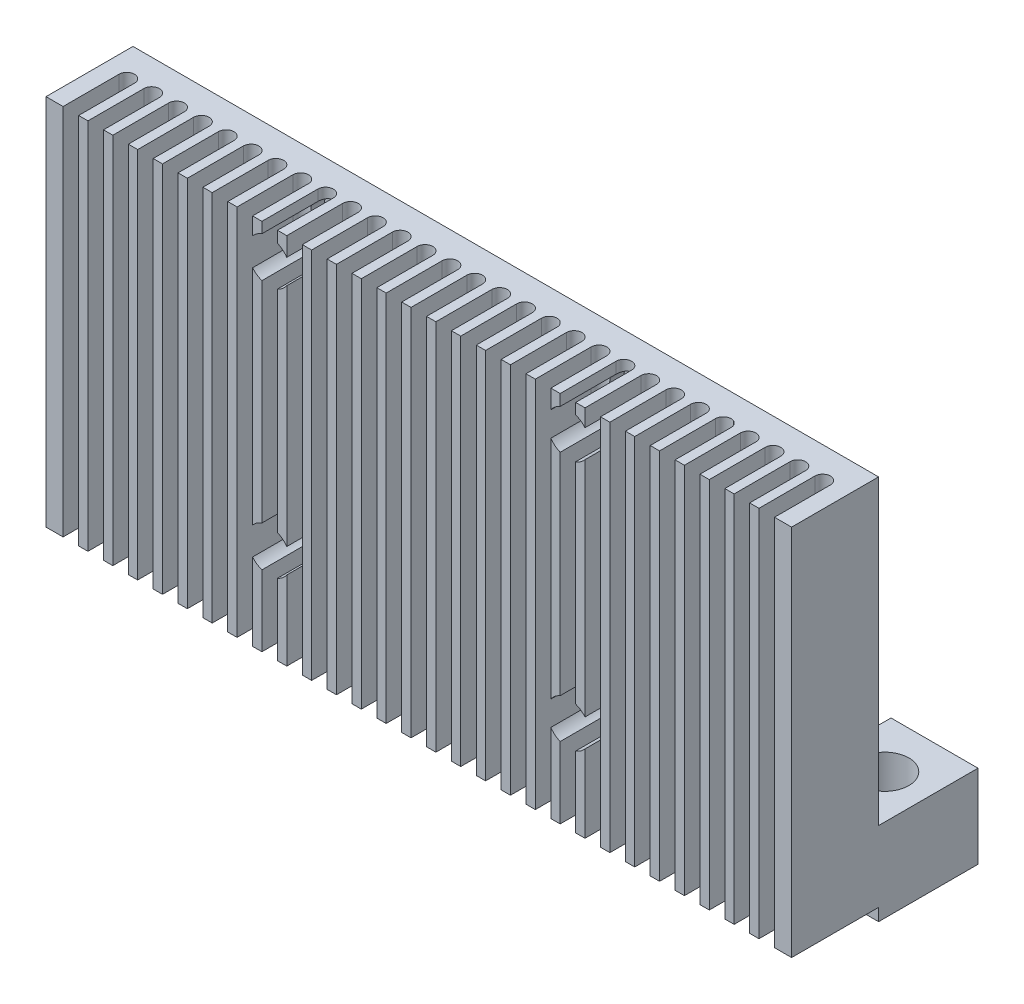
from build123d import *

# Parameters (mm, degrees)
SKETCH1_W                      = 76.2
SKETCH1_H                      = 8.89
BOSS_EXTRUDE1_DEPTH            = 19.05
CUT_EXTRUDE1_DEPTH             = 44.514877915
LPATTERN1_COUNT                = 15
LPATTERN1_PITCH                = 2.54
LPATTERN1_COL_COUNT            = 15
LPATTERN1_COL_PITCH            = 2.54
CBORE_FOR_M2_SHCS1_D           = 2.6
CBORE_FOR_M2_SHCS1_CBORE_D     = 4.4
CBORE_FOR_M2_SHCS1_CBORE_DEPTH = 7.842
BOSS_EXTRUDE2_DEPTH            = 1.27
BOSS_EXTRUDE2_DEPTH_BACK       = 7.239
SKETCH14_W                     = 8.89
SKETCH14_H                     = 10.16
F_10_0_1935_DIAMETER_HOLE1_D   = 4.9149


with BuildPart() as part:
    # Sketch1 → Boss-Extrude1 (new, symmetric)
    with BuildSketch(Plane(origin=(0, 0, 0), x_dir=(1, 0, 0), z_dir=(0, 1, 0))):
        with Locations((0, 4.445)):
            Rectangle(SKETCH1_W, SKETCH1_H)
    extrude(amount=BOSS_EXTRUDE1_DEPTH, both=True)

    # Sketch12 → Cut-Extrude1 (cut, symmetric)
    with BuildSketch(Plane(origin=(0, 0, 0), x_dir=(1, 0, 0), z_dir=(0, 1, 0))):
        with BuildLine():
            Line((-0.79375, 0), (-0.79375, 5.715))
            ThreePointArc((-0.79375, 5.715), (0, 6.50875), (0.79375, 5.715))
            Line((0.79375, 5.715), (0.79375, 0))
            Line((0.79375, 0), (-0.79375, 0))
        make_face()
    cut_extrude1 = extrude(amount=CUT_EXTRUDE1_DEPTH, both=True, mode=Mode.SUBTRACT)

    # LPattern1: Cut-Extrude1 ×15
    with Locations(*[(i * LPATTERN1_PITCH, 0, 0) for i in range(1, LPATTERN1_COUNT)]):
        add(cut_extrude1, mode=Mode.SUBTRACT)

    # LPattern1 col: Cut-Extrude1 ×15
    with Locations(*[(-i * LPATTERN1_COL_PITCH, 0, 0) for i in range(1, LPATTERN1_COL_COUNT)]):
        add(cut_extrude1, mode=Mode.SUBTRACT)

    # CBORE for M2 SHCS1 (through all)
    with Locations(Plane.XY):
        with Locations((-15.3, 15.875), (15.3, 15.875), (15.3, -9.725), (-15.3, -9.725)):
            CounterBoreHole(CBORE_FOR_M2_SHCS1_D / 2, CBORE_FOR_M2_SHCS1_CBORE_D / 2, CBORE_FOR_M2_SHCS1_CBORE_DEPTH)

    # Sketch14 → Boss-Extrude2 (add, two sides: drawn at the far end of the back side and taken through both)
    with BuildSketch(Plane(origin=(0, -19.05, 0), x_dir=(-1, 0, 0), z_dir=(0, -1, 0)).offset(-BOSS_EXTRUDE2_DEPTH_BACK)):
        with Locations((-33.655, 13.97)):
            Rectangle(SKETCH14_W, SKETCH14_H)
        with Locations((33.655, 13.97)):
            Rectangle(SKETCH14_W, SKETCH14_H)
    extrude(amount=BOSS_EXTRUDE2_DEPTH + BOSS_EXTRUDE2_DEPTH_BACK)

    # 10 _0.1935_ Diameter Hole1 (through all)
    with Locations(Plane(origin=(0, -11.811, 0), x_dir=(1, 0, 0), z_dir=(0, 1, 0))):
        with Locations((33.655, 13.97), (-33.655, 13.97)):
            Hole(F_10_0_1935_DIAMETER_HOLE1_D / 2)


solid = part.part
